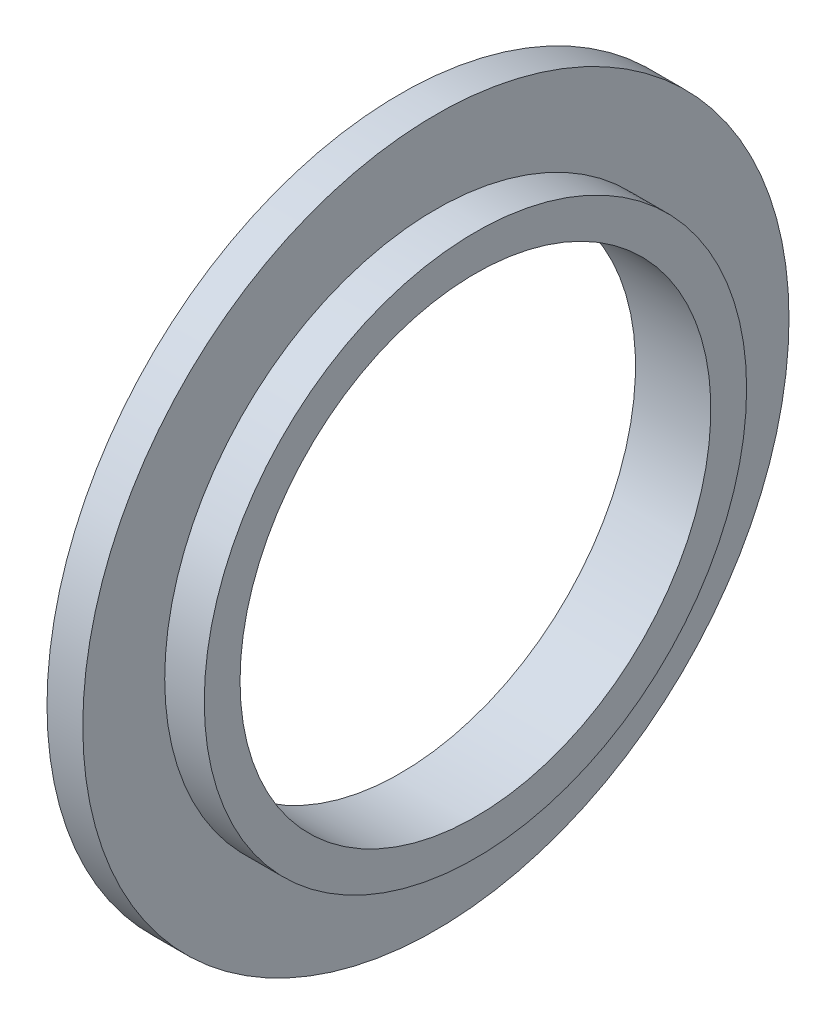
from build123d import *


with BuildPart() as part:
    # Esquisse1 → Base-R_vol.-Mince (revolve)
    with BuildSketch(Plane.XY, mode=Mode.PRIVATE) as base_r_vol_mince_sk:
        Polygon((8, 25), (0, 25), (0, 37.5), (3.8, 37.5), (3.8, 28.8), (8, 28.8), align=None)
    revolve(base_r_vol_mince_sk.sketch.rotate(Axis((-20, 0, 0), (1, 0, 0)), 90), axis=Axis((-20, 0, 0), (1, 0, 0)))


solid = part.part
